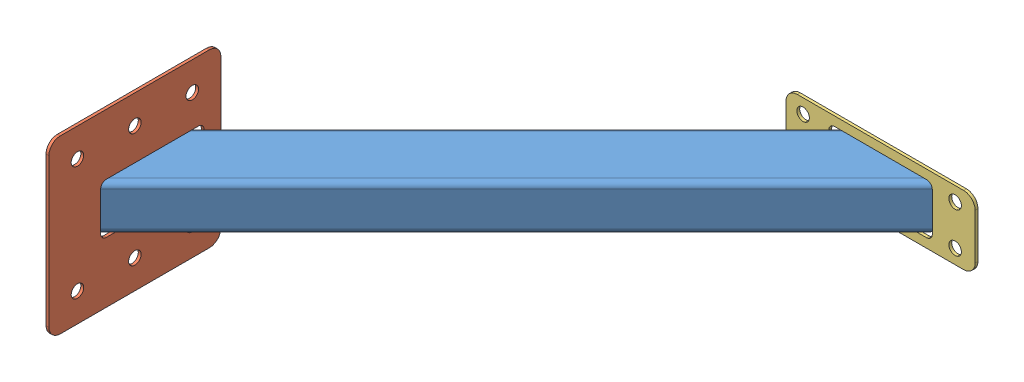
SolidWorks assembly Złożenie1.sldasm, configuration Domyślna (file format 12000). Lengths in mm.
Overall size (807.79 300 822.34).
3 component instances, 3 part files, 7 mates.
Components (placement in the parent):
- odkos dol — profil-1: odkos dol — profil.SLDPRT [Domyślna<Obrobiona>] at (-448.2619 23.9754 652.0236) size (728.79 80 728.79)
- marka odkosu dolna-1: marka odkosu dolna.sldprt [Domyślna<Obrobiona>] at (-448.2619 23.9754 649.3657) size (5 300 300.92)
- marka odkosu gorna-1: marka odkosu gorna.sldprt [Domyślna<Obrobiona>] at (-450.4751 23.9754 652.0236) size (330.92 120 5)
Mates (geometry in assembly coordinates):
- Wspólnie1: coincident: line of odkos dol — profil-1 through (289.4191 -6.0246 -364.3934) axis (0 1 0); plane of marka odkosu gorna-1 through (368.4037 -36.0246 -362.8327) normal (0.019756 0 -0.999805)
- Wspólnie2: coincident: plane of odkos dol — profil-1 through (-439.3677 23.9754 652.0236) normal (-1 0 0); plane of marka odkosu dolna-1 through (-439.3677 -126.0246 457.9487) normal (-1 0 0)
- Szerokość1: width: plane of marka odkosu dolna-1 through (-434.3677 -20.0246 186.373) normal (0 1 0); plane of odkos dol — profil-1 through (-434.3677 67.9754 186.373) normal (0 -1 0); plane of marka odkosu dolna-1 through (-1184.0914 -16.0246 1094.975) normal (0 -1 0); plane of odkos dol — profil-1 through (-1254.802 63.9754 1024.2643) normal (0 1 0)
- Odległość2: distance = 37.6579 mm: line of odkos dol — profil-1 through (-439.3677 53.9754 194.6878) axis (0 -1 0); plane of marka odkosu dolna-1 through (-448.2619 23.9754 157.0299) normal (0 0 -1)
- Odległość3: distance = 79 mm: plane of marka odkosu gorna-1 through (368.4191 23.9754 652.0236) normal (1 0 0); line of odkos dol — profil-1 through (289.4191 -6.0246 -364.3934) axis (0 1 0)
- Szerokość3: width: plane of odkos dol — profil-1 through (-1254.802 63.9754 1024.2643) normal (0 1 0); plane of marka odkosu gorna-1 through (-1184.0914 -16.0246 1094.975) normal (0 -1 0); plane of odkos dol — profil-1 through (368.3049 -36.0246 -357.8337) normal (0 -1 0); plane of marka odkosu gorna-1 through (368.3049 83.9754 -357.8337) normal (0 1 0)
- Wspólnie6: coincident aligned: plane of odkos dol — profil-1 through (-448.2619 23.9754 -364.3934) normal (0 0 -1); plane of marka odkosu gorna-1 through (368.4191 -36.0246 -364.3934) normal (0 0 -1)
